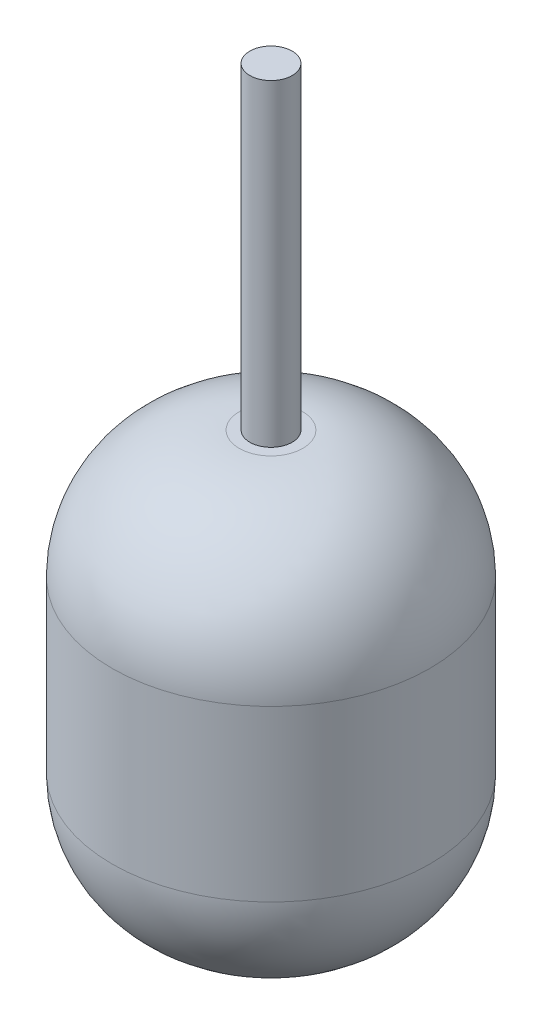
from build123d import *

# Parameters (mm, degrees)
SKETCH1_R           = 15
BOSS_EXTRUDE1_DEPTH = 40
FILLET1_R           = 12
SKETCH2_R           = 2
BOSS_EXTRUDE2_DEPTH = 30


with BuildPart() as part:
    # Sketch1 → Boss-Extrude1 (new body)
    with BuildSketch(Plane(origin=(0, 0, 0), x_dir=(1, 0, 0), z_dir=(0, 1, 0))):
        with Locations(Location((0, 0, 0), (0, 0, 270))):
            Circle(SKETCH1_R)
    extrude(amount=BOSS_EXTRUDE1_DEPTH)

    # Fillet1
    fillet1_edges = [part.edges().sort_by_distance(p)[0] for p in [
        (0, 0, -15),
        (0, 40, -15),
    ]]
    fillet(fillet1_edges, radius=FILLET1_R)

    # Sketch2 → Boss-Extrude2 (add)
    with BuildSketch(Plane(origin=(0, 40, 0), x_dir=(1, 0, 0), z_dir=(0, 1, 0))):
        with Locations(Location((0, 0, 0), (0, 0, 270))):
            Circle(SKETCH2_R)
    extrude(amount=BOSS_EXTRUDE2_DEPTH)


solid = part.part
